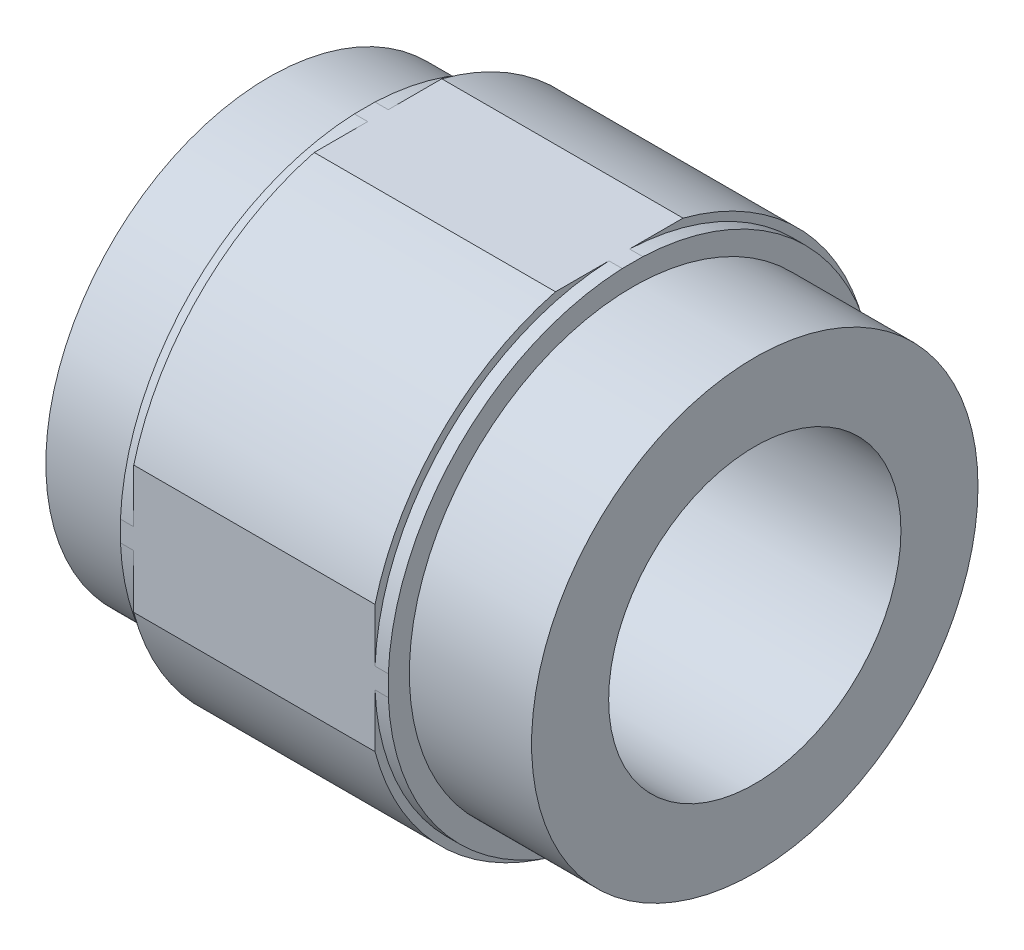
ISO-10303-21;
HEADER;
FILE_DESCRIPTION(('STEP AP214'),'2;1');
FILE_NAME('part.step','',(''),(''),'','','');
FILE_SCHEMA(('AUTOMOTIVE_DESIGN { 1 0 10303 214 1 1 1 1 }'));
ENDSEC;
DATA;
#1=APPLICATION_CONTEXT('core data for automotive mechanical design processes');
#2=APPLICATION_PROTOCOL_DEFINITION('international standard','automotive_design',2000,#1);
#3=PRODUCT_CONTEXT('',#1,'mechanical');
#4=PRODUCT('Part','Part','',(#3));
#5=PRODUCT_RELATED_PRODUCT_CATEGORY('part','',(#4));
#6=PRODUCT_DEFINITION_FORMATION('','',#4);
#7=PRODUCT_DEFINITION_CONTEXT('part definition',#1,'design');
#8=PRODUCT_DEFINITION('design','',#6,#7);
#9=PRODUCT_DEFINITION_SHAPE('','',#8);
#10=(LENGTH_UNIT() NAMED_UNIT(*) SI_UNIT(.MILLI.,.METRE.));
#11=(NAMED_UNIT(*) PLANE_ANGLE_UNIT() SI_UNIT($,.RADIAN.));
#12=(NAMED_UNIT(*) SI_UNIT($,.STERADIAN.) SOLID_ANGLE_UNIT());
#13=UNCERTAINTY_MEASURE_WITH_UNIT(LENGTH_MEASURE(1.E-05),#10,'distance_accuracy_value','');
#14=(GEOMETRIC_REPRESENTATION_CONTEXT(3) GLOBAL_UNCERTAINTY_ASSIGNED_CONTEXT((#13)) GLOBAL_UNIT_ASSIGNED_CONTEXT((#10,
#11,#12)) REPRESENTATION_CONTEXT('',''));
#15=CARTESIAN_POINT('',(0.,0.,0.));
#16=DIRECTION('',(0.,0.,1.));
#17=DIRECTION('',(1.,0.,0.));
#18=AXIS2_PLACEMENT_3D('',#15,#16,#17);
#19=CARTESIAN_POINT('',(-22.7,0.,0.));
#20=DIRECTION('',(1.,0.,0.));
#21=DIRECTION('',(0.,0.,-1.));
#22=AXIS2_PLACEMENT_3D('',#19,#20,#21);
#23=PLANE('',#22);
#24=CARTESIAN_POINT('',(-22.7,0.,0.));
#25=DIRECTION('',(1.,0.,0.));
#26=DIRECTION('',(0.,0.,-1.));
#27=AXIS2_PLACEMENT_3D('',#24,#25,#26);
#28=CIRCLE('',#27,46.);
#29=CARTESIAN_POINT('',(-22.7,-1.9364916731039,-45.959221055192));
#30=VERTEX_POINT('',#29);
#31=CARTESIAN_POINT('',(-22.7,-45.959221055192,-1.93649167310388));
#32=VERTEX_POINT('',#31);
#33=EDGE_CURVE('E189',#30,#32,#28,.F.);
#34=ORIENTED_EDGE('',*,*,#33,.F.);
#35=DIRECTION('',(0.,-1.,0.));
#36=VECTOR('',#35,1.);
#37=CARTESIAN_POINT('',(-22.7,-12.,-45.959221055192));
#38=LINE('',#37,#36);
#39=CARTESIAN_POINT('',(-22.7,-12.,-45.959221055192));
#40=VERTEX_POINT('',#39);
#41=EDGE_CURVE('E179',#30,#40,#38,.T.);
#42=ORIENTED_EDGE('',*,*,#41,.T.);
#43=CARTESIAN_POINT('',(-22.7,0.,0.));
#44=DIRECTION('',(1.,0.,0.));
#45=DIRECTION('',(0.,0.,-1.));
#46=AXIS2_PLACEMENT_3D('',#43,#44,#45);
#47=CIRCLE('',#46,47.5);
#48=CARTESIAN_POINT('',(-22.7,-45.959221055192,-12.));
#49=VERTEX_POINT('',#48);
#50=EDGE_CURVE('E19',#49,#40,#47,.T.);
#51=ORIENTED_EDGE('',*,*,#50,.F.);
#52=DIRECTION('',(0.,0.,1.));
#53=VECTOR('',#52,1.);
#54=CARTESIAN_POINT('',(-22.7,-45.959221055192,12.));
#55=LINE('',#54,#53);
#56=EDGE_CURVE('E176',#49,#32,#55,.T.);
#57=ORIENTED_EDGE('',*,*,#56,.T.);
#58=EDGE_LOOP('',(#34,#42,#51,#57));
#59=FACE_BOUND('',#58,.T.);
#60=ADVANCED_FACE('F15',(#59),#23,.F.);
#61=CARTESIAN_POINT('',(0.,0.,0.));
#62=DIRECTION('',(1.,0.,0.));
#63=DIRECTION('',(0.,0.,-1.));
#64=AXIS2_PLACEMENT_3D('',#61,#62,#63);
#65=CYLINDRICAL_SURFACE('',#64,47.5);
#66=DIRECTION('',(1.,0.,0.));
#67=VECTOR('',#66,1.);
#68=CARTESIAN_POINT('',(-25.2,-12.,-45.959221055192));
#69=LINE('',#68,#67);
#70=CARTESIAN_POINT('',(22.7,-12.,-45.959221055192));
#71=VERTEX_POINT('',#70);
#72=EDGE_CURVE('E323',#40,#71,#69,.T.);
#73=ORIENTED_EDGE('',*,*,#72,.T.);
#74=CARTESIAN_POINT('',(22.7,0.,0.));
#75=DIRECTION('',(1.,0.,0.));
#76=DIRECTION('',(0.,0.,-1.));
#77=AXIS2_PLACEMENT_3D('',#74,#75,#76);
#78=CIRCLE('',#77,47.5);
#79=CARTESIAN_POINT('',(22.7,-45.959221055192,-12.));
#80=VERTEX_POINT('',#79);
#81=EDGE_CURVE('E182',#71,#80,#78,.F.);
#82=ORIENTED_EDGE('',*,*,#81,.T.);
#83=DIRECTION('',(1.,0.,0.));
#84=VECTOR('',#83,1.);
#85=CARTESIAN_POINT('',(-25.2,-45.959221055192,-12.));
#86=LINE('',#85,#84);
#87=EDGE_CURVE('E184',#80,#49,#86,.F.);
#88=ORIENTED_EDGE('',*,*,#87,.T.);
#89=ORIENTED_EDGE('',*,*,#50,.T.);
#90=EDGE_LOOP('',(#73,#82,#88,#89));
#91=FACE_BOUND('',#90,.T.);
#92=ADVANCED_FACE('F185',(#91),#65,.T.);
#93=CARTESIAN_POINT('',(22.7,0.,0.));
#94=DIRECTION('',(-1.,0.,0.));
#95=DIRECTION('',(0.,0.,1.));
#96=AXIS2_PLACEMENT_3D('',#93,#94,#95);
#97=PLANE('',#96);
#98=ORIENTED_EDGE('',*,*,#81,.F.);
#99=DIRECTION('',(0.,-1.,0.));
#100=VECTOR('',#99,1.);
#101=CARTESIAN_POINT('',(22.7,-12.,-45.959221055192));
#102=LINE('',#101,#100);
#103=CARTESIAN_POINT('',(22.7,-1.9364916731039,-45.959221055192));
#104=VERTEX_POINT('',#103);
#105=EDGE_CURVE('E321',#71,#104,#102,.F.);
#106=ORIENTED_EDGE('',*,*,#105,.T.);
#107=CARTESIAN_POINT('',(22.7,0.,0.));
#108=DIRECTION('',(1.,0.,0.));
#109=DIRECTION('',(0.,0.,-1.));
#110=AXIS2_PLACEMENT_3D('',#107,#108,#109);
#111=CIRCLE('',#110,46.);
#112=CARTESIAN_POINT('',(22.7,-45.959221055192,-1.93649167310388));
#113=VERTEX_POINT('',#112);
#114=EDGE_CURVE('E261',#113,#104,#111,.T.);
#115=ORIENTED_EDGE('',*,*,#114,.F.);
#116=DIRECTION('',(0.,0.,1.));
#117=VECTOR('',#116,1.);
#118=CARTESIAN_POINT('',(22.7,-45.959221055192,12.));
#119=LINE('',#118,#117);
#120=EDGE_CURVE('E329',#113,#80,#119,.F.);
#121=ORIENTED_EDGE('',*,*,#120,.T.);
#122=EDGE_LOOP('',(#98,#106,#115,#121));
#123=FACE_BOUND('',#122,.T.);
#124=ADVANCED_FACE('F655',(#123),#97,.F.);
#125=CARTESIAN_POINT('',(-22.7,0.,0.));
#126=DIRECTION('',(1.,0.,0.));
#127=DIRECTION('',(0.,0.,-1.));
#128=AXIS2_PLACEMENT_3D('',#125,#126,#127);
#129=PLANE('',#128);
#130=CARTESIAN_POINT('',(-22.7,0.,0.));
#131=DIRECTION('',(1.,0.,0.));
#132=DIRECTION('',(0.,0.,-1.));
#133=AXIS2_PLACEMENT_3D('',#130,#131,#132);
#134=CIRCLE('',#133,46.);
#135=CARTESIAN_POINT('',(-22.7,45.959221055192,-1.93649167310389));
#136=VERTEX_POINT('',#135);
#137=CARTESIAN_POINT('',(-22.7,1.93649167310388,-45.959221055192));
#138=VERTEX_POINT('',#137);
#139=EDGE_CURVE('E267',#136,#138,#134,.F.);
#140=ORIENTED_EDGE('',*,*,#139,.F.);
#141=DIRECTION('',(0.,0.,-1.));
#142=VECTOR('',#141,1.);
#143=CARTESIAN_POINT('',(-22.7,45.959221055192,-12.));
#144=LINE('',#143,#142);
#145=CARTESIAN_POINT('',(-22.7,45.959221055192,-12.));
#146=VERTEX_POINT('',#145);
#147=EDGE_CURVE('E302',#136,#146,#144,.T.);
#148=ORIENTED_EDGE('',*,*,#147,.T.);
#149=CARTESIAN_POINT('',(-22.7,0.,0.));
#150=DIRECTION('',(1.,0.,0.));
#151=DIRECTION('',(0.,0.,-1.));
#152=AXIS2_PLACEMENT_3D('',#149,#150,#151);
#153=CIRCLE('',#152,47.5);
#154=CARTESIAN_POINT('',(-22.7,12.,-45.959221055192));
#155=VERTEX_POINT('',#154);
#156=EDGE_CURVE('E287',#155,#146,#153,.T.);
#157=ORIENTED_EDGE('',*,*,#156,.F.);
#158=DIRECTION('',(0.,-1.,0.));
#159=VECTOR('',#158,1.);
#160=CARTESIAN_POINT('',(-22.7,-12.,-45.959221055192));
#161=LINE('',#160,#159);
#162=EDGE_CURVE('E320',#155,#138,#161,.T.);
#163=ORIENTED_EDGE('',*,*,#162,.T.);
#164=EDGE_LOOP('',(#140,#148,#157,#163));
#165=FACE_BOUND('',#164,.T.);
#166=ADVANCED_FACE('F648',(#165),#129,.F.);
#167=CARTESIAN_POINT('',(0.,0.,0.));
#168=DIRECTION('',(1.,0.,0.));
#169=DIRECTION('',(0.,0.,-1.));
#170=AXIS2_PLACEMENT_3D('',#167,#168,#169);
#171=CYLINDRICAL_SURFACE('',#170,47.5);
#172=DIRECTION('',(1.,0.,0.));
#173=VECTOR('',#172,1.);
#174=CARTESIAN_POINT('',(-25.2,45.959221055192,-12.));
#175=LINE('',#174,#173);
#176=CARTESIAN_POINT('',(22.7,45.959221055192,-12.));
#177=VERTEX_POINT('',#176);
#178=EDGE_CURVE('E293',#146,#177,#175,.T.);
#179=ORIENTED_EDGE('',*,*,#178,.T.);
#180=CARTESIAN_POINT('',(22.7,0.,0.));
#181=DIRECTION('',(1.,0.,0.));
#182=DIRECTION('',(0.,0.,-1.));
#183=AXIS2_PLACEMENT_3D('',#180,#181,#182);
#184=CIRCLE('',#183,47.5);
#185=CARTESIAN_POINT('',(22.7,12.,-45.959221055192));
#186=VERTEX_POINT('',#185);
#187=EDGE_CURVE('E285',#177,#186,#184,.F.);
#188=ORIENTED_EDGE('',*,*,#187,.T.);
#189=DIRECTION('',(1.,0.,0.));
#190=VECTOR('',#189,1.);
#191=CARTESIAN_POINT('',(-25.2,12.,-45.959221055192));
#192=LINE('',#191,#190);
#193=EDGE_CURVE('E264',#186,#155,#192,.F.);
#194=ORIENTED_EDGE('',*,*,#193,.T.);
#195=ORIENTED_EDGE('',*,*,#156,.T.);
#196=EDGE_LOOP('',(#179,#188,#194,#195));
#197=FACE_BOUND('',#196,.T.);
#198=ADVANCED_FACE('F292',(#197),#171,.T.);
#199=CARTESIAN_POINT('',(22.7,0.,0.));
#200=DIRECTION('',(-1.,0.,0.));
#201=DIRECTION('',(0.,0.,1.));
#202=AXIS2_PLACEMENT_3D('',#199,#200,#201);
#203=PLANE('',#202);
#204=ORIENTED_EDGE('',*,*,#187,.F.);
#205=DIRECTION('',(0.,0.,-1.));
#206=VECTOR('',#205,1.);
#207=CARTESIAN_POINT('',(22.7,45.959221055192,-12.));
#208=LINE('',#207,#206);
#209=CARTESIAN_POINT('',(22.7,45.959221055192,-1.93649167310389));
#210=VERTEX_POINT('',#209);
#211=EDGE_CURVE('E304',#177,#210,#208,.F.);
#212=ORIENTED_EDGE('',*,*,#211,.T.);
#213=CARTESIAN_POINT('',(22.7,0.,0.));
#214=DIRECTION('',(1.,0.,0.));
#215=DIRECTION('',(0.,0.,-1.));
#216=AXIS2_PLACEMENT_3D('',#213,#214,#215);
#217=CIRCLE('',#216,46.);
#218=CARTESIAN_POINT('',(22.7,1.93649167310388,-45.959221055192));
#219=VERTEX_POINT('',#218);
#220=EDGE_CURVE('E256',#219,#210,#217,.T.);
#221=ORIENTED_EDGE('',*,*,#220,.F.);
#222=DIRECTION('',(0.,-1.,0.));
#223=VECTOR('',#222,1.);
#224=CARTESIAN_POINT('',(22.7,-12.,-45.959221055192));
#225=LINE('',#224,#223);
#226=EDGE_CURVE('E315',#219,#186,#225,.F.);
#227=ORIENTED_EDGE('',*,*,#226,.T.);
#228=EDGE_LOOP('',(#204,#212,#221,#227));
#229=FACE_BOUND('',#228,.T.);
#230=ADVANCED_FACE('F529',(#229),#203,.F.);
#231=CARTESIAN_POINT('',(0.,0.,0.));
#232=DIRECTION('',(1.,0.,0.));
#233=DIRECTION('',(0.,0.,-1.));
#234=AXIS2_PLACEMENT_3D('',#231,#232,#233);
#235=CYLINDRICAL_SURFACE('',#234,47.5);
#236=DIRECTION('',(1.,0.,0.));
#237=VECTOR('',#236,1.);
#238=CARTESIAN_POINT('',(-25.2,-12.,45.959221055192));
#239=LINE('',#238,#237);
#240=CARTESIAN_POINT('',(22.7,-12.,45.959221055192));
#241=VERTEX_POINT('',#240);
#242=CARTESIAN_POINT('',(-22.7,-12.,45.959221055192));
#243=VERTEX_POINT('',#242);
#244=EDGE_CURVE('E254',#241,#243,#239,.F.);
#245=ORIENTED_EDGE('',*,*,#244,.T.);
#246=CARTESIAN_POINT('',(-22.7,0.,0.));
#247=DIRECTION('',(1.,0.,0.));
#248=DIRECTION('',(0.,0.,-1.));
#249=AXIS2_PLACEMENT_3D('',#246,#247,#248);
#250=CIRCLE('',#249,47.5);
#251=CARTESIAN_POINT('',(-22.7,-45.959221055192,12.));
#252=VERTEX_POINT('',#251);
#253=EDGE_CURVE('E283',#243,#252,#250,.T.);
#254=ORIENTED_EDGE('',*,*,#253,.T.);
#255=DIRECTION('',(1.,0.,0.));
#256=VECTOR('',#255,1.);
#257=CARTESIAN_POINT('',(-25.2,-45.959221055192,12.));
#258=LINE('',#257,#256);
#259=CARTESIAN_POINT('',(22.7,-45.959221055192,12.));
#260=VERTEX_POINT('',#259);
#261=EDGE_CURVE('E331',#252,#260,#258,.T.);
#262=ORIENTED_EDGE('',*,*,#261,.T.);
#263=CARTESIAN_POINT('',(22.7,0.,0.));
#264=DIRECTION('',(1.,0.,0.));
#265=DIRECTION('',(0.,0.,-1.));
#266=AXIS2_PLACEMENT_3D('',#263,#264,#265);
#267=CIRCLE('',#266,47.5);
#268=EDGE_CURVE('E276',#260,#241,#267,.F.);
#269=ORIENTED_EDGE('',*,*,#268,.T.);
#270=EDGE_LOOP('',(#245,#254,#262,#269));
#271=FACE_BOUND('',#270,.T.);
#272=ADVANCED_FACE('F520',(#271),#235,.T.);
#273=CARTESIAN_POINT('',(-22.7,0.,0.));
#274=DIRECTION('',(1.,0.,0.));
#275=DIRECTION('',(0.,0.,-1.));
#276=AXIS2_PLACEMENT_3D('',#273,#274,#275);
#277=PLANE('',#276);
#278=ORIENTED_EDGE('',*,*,#253,.F.);
#279=DIRECTION('',(0.,1.,0.));
#280=VECTOR('',#279,1.);
#281=CARTESIAN_POINT('',(-22.7,12.,45.959221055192));
#282=LINE('',#281,#280);
#283=CARTESIAN_POINT('',(-22.7,-1.93649167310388,45.959221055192));
#284=VERTEX_POINT('',#283);
#285=EDGE_CURVE('E352',#243,#284,#282,.T.);
#286=ORIENTED_EDGE('',*,*,#285,.T.);
#287=CARTESIAN_POINT('',(-22.7,0.,0.));
#288=DIRECTION('',(1.,0.,0.));
#289=DIRECTION('',(0.,0.,-1.));
#290=AXIS2_PLACEMENT_3D('',#287,#288,#289);
#291=CIRCLE('',#290,46.);
#292=CARTESIAN_POINT('',(-22.7,-45.959221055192,1.93649167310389));
#293=VERTEX_POINT('',#292);
#294=EDGE_CURVE('E273',#293,#284,#291,.F.);
#295=ORIENTED_EDGE('',*,*,#294,.F.);
#296=DIRECTION('',(0.,0.,1.));
#297=VECTOR('',#296,1.);
#298=CARTESIAN_POINT('',(-22.7,-45.959221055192,12.));
#299=LINE('',#298,#297);
#300=EDGE_CURVE('E199',#293,#252,#299,.T.);
#301=ORIENTED_EDGE('',*,*,#300,.T.);
#302=EDGE_LOOP('',(#278,#286,#295,#301));
#303=FACE_BOUND('',#302,.T.);
#304=ADVANCED_FACE('F521',(#303),#277,.F.);
#305=CARTESIAN_POINT('',(-22.7,0.,0.));
#306=DIRECTION('',(1.,0.,0.));
#307=DIRECTION('',(0.,0.,-1.));
#308=AXIS2_PLACEMENT_3D('',#305,#306,#307);
#309=PLANE('',#308);
#310=CARTESIAN_POINT('',(-22.7,0.,0.));
#311=DIRECTION('',(1.,0.,0.));
#312=DIRECTION('',(0.,0.,-1.));
#313=AXIS2_PLACEMENT_3D('',#310,#311,#312);
#314=CIRCLE('',#313,47.5);
#315=CARTESIAN_POINT('',(-22.7,45.959221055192,12.));
#316=VERTEX_POINT('',#315);
#317=CARTESIAN_POINT('',(-22.7,12.,45.959221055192));
#318=VERTEX_POINT('',#317);
#319=EDGE_CURVE('E280',#316,#318,#314,.T.);
#320=ORIENTED_EDGE('',*,*,#319,.F.);
#321=DIRECTION('',(0.,0.,-1.));
#322=VECTOR('',#321,1.);
#323=CARTESIAN_POINT('',(-22.7,45.959221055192,-12.));
#324=LINE('',#323,#322);
#325=CARTESIAN_POINT('',(-22.7,45.959221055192,1.93649167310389));
#326=VERTEX_POINT('',#325);
#327=EDGE_CURVE('E312',#316,#326,#324,.T.);
#328=ORIENTED_EDGE('',*,*,#327,.T.);
#329=CARTESIAN_POINT('',(-22.7,0.,0.));
#330=DIRECTION('',(1.,0.,0.));
#331=DIRECTION('',(0.,0.,-1.));
#332=AXIS2_PLACEMENT_3D('',#329,#330,#331);
#333=CIRCLE('',#332,46.);
#334=CARTESIAN_POINT('',(-22.7,1.9364916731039,45.959221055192));
#335=VERTEX_POINT('',#334);
#336=EDGE_CURVE('E270',#335,#326,#333,.F.);
#337=ORIENTED_EDGE('',*,*,#336,.F.);
#338=DIRECTION('',(0.,1.,0.));
#339=VECTOR('',#338,1.);
#340=CARTESIAN_POINT('',(-22.7,12.,45.959221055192));
#341=LINE('',#340,#339);
#342=EDGE_CURVE('E357',#335,#318,#341,.T.);
#343=ORIENTED_EDGE('',*,*,#342,.T.);
#344=EDGE_LOOP('',(#320,#328,#337,#343));
#345=FACE_BOUND('',#344,.T.);
#346=ADVANCED_FACE('F374',(#345),#309,.F.);
#347=CARTESIAN_POINT('',(0.,0.,0.));
#348=DIRECTION('',(1.,0.,0.));
#349=DIRECTION('',(0.,0.,-1.));
#350=AXIS2_PLACEMENT_3D('',#347,#348,#349);
#351=CYLINDRICAL_SURFACE('',#350,47.5);
#352=DIRECTION('',(1.,0.,0.));
#353=VECTOR('',#352,1.);
#354=CARTESIAN_POINT('',(-25.2,45.959221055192,12.));
#355=LINE('',#354,#353);
#356=CARTESIAN_POINT('',(22.7,45.959221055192,12.));
#357=VERTEX_POINT('',#356);
#358=EDGE_CURVE('E259',#357,#316,#355,.F.);
#359=ORIENTED_EDGE('',*,*,#358,.T.);
#360=ORIENTED_EDGE('',*,*,#319,.T.);
#361=DIRECTION('',(1.,0.,0.));
#362=VECTOR('',#361,1.);
#363=CARTESIAN_POINT('',(-25.2,12.,45.959221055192));
#364=LINE('',#363,#362);
#365=CARTESIAN_POINT('',(22.7,12.,45.959221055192));
#366=VERTEX_POINT('',#365);
#367=EDGE_CURVE('E355',#318,#366,#364,.T.);
#368=ORIENTED_EDGE('',*,*,#367,.T.);
#369=CARTESIAN_POINT('',(22.7,0.,0.));
#370=DIRECTION('',(1.,0.,0.));
#371=DIRECTION('',(0.,0.,-1.));
#372=AXIS2_PLACEMENT_3D('',#369,#370,#371);
#373=CIRCLE('',#372,47.5);
#374=EDGE_CURVE('E278',#366,#357,#373,.F.);
#375=ORIENTED_EDGE('',*,*,#374,.T.);
#376=EDGE_LOOP('',(#359,#360,#368,#375));
#377=FACE_BOUND('',#376,.T.);
#378=ADVANCED_FACE('F368',(#377),#351,.T.);
#379=CARTESIAN_POINT('',(22.7,0.,0.));
#380=DIRECTION('',(-1.,0.,0.));
#381=DIRECTION('',(0.,0.,1.));
#382=AXIS2_PLACEMENT_3D('',#379,#380,#381);
#383=PLANE('',#382);
#384=CARTESIAN_POINT('',(22.7,0.,0.));
#385=DIRECTION('',(1.,0.,0.));
#386=DIRECTION('',(0.,0.,-1.));
#387=AXIS2_PLACEMENT_3D('',#384,#385,#386);
#388=CIRCLE('',#387,46.);
#389=CARTESIAN_POINT('',(22.7,45.959221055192,1.93649167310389));
#390=VERTEX_POINT('',#389);
#391=CARTESIAN_POINT('',(22.7,1.9364916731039,45.959221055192));
#392=VERTEX_POINT('',#391);
#393=EDGE_CURVE('E251',#390,#392,#388,.T.);
#394=ORIENTED_EDGE('',*,*,#393,.F.);
#395=DIRECTION('',(0.,0.,-1.));
#396=VECTOR('',#395,1.);
#397=CARTESIAN_POINT('',(22.7,45.959221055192,-12.));
#398=LINE('',#397,#396);
#399=EDGE_CURVE('E362',#390,#357,#398,.F.);
#400=ORIENTED_EDGE('',*,*,#399,.T.);
#401=ORIENTED_EDGE('',*,*,#374,.F.);
#402=DIRECTION('',(0.,1.,0.));
#403=VECTOR('',#402,1.);
#404=CARTESIAN_POINT('',(22.7,12.,45.959221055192));
#405=LINE('',#404,#403);
#406=EDGE_CURVE('E353',#366,#392,#405,.F.);
#407=ORIENTED_EDGE('',*,*,#406,.T.);
#408=EDGE_LOOP('',(#394,#400,#401,#407));
#409=FACE_BOUND('',#408,.T.);
#410=ADVANCED_FACE('F387',(#409),#383,.F.);
#411=CARTESIAN_POINT('',(22.7,0.,0.));
#412=DIRECTION('',(-1.,0.,0.));
#413=DIRECTION('',(0.,0.,1.));
#414=AXIS2_PLACEMENT_3D('',#411,#412,#413);
#415=PLANE('',#414);
#416=CARTESIAN_POINT('',(22.7,0.,0.));
#417=DIRECTION('',(1.,0.,0.));
#418=DIRECTION('',(0.,0.,-1.));
#419=AXIS2_PLACEMENT_3D('',#416,#417,#418);
#420=CIRCLE('',#419,46.);
#421=CARTESIAN_POINT('',(22.7,-1.93649167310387,45.959221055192));
#422=VERTEX_POINT('',#421);
#423=CARTESIAN_POINT('',(22.7,-45.959221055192,1.9364916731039));
#424=VERTEX_POINT('',#423);
#425=EDGE_CURVE('E248',#422,#424,#420,.T.);
#426=ORIENTED_EDGE('',*,*,#425,.F.);
#427=DIRECTION('',(0.,1.,0.));
#428=VECTOR('',#427,1.);
#429=CARTESIAN_POINT('',(22.7,12.,45.959221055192));
#430=LINE('',#429,#428);
#431=EDGE_CURVE('E346',#422,#241,#430,.F.);
#432=ORIENTED_EDGE('',*,*,#431,.T.);
#433=ORIENTED_EDGE('',*,*,#268,.F.);
#434=DIRECTION('',(0.,0.,1.));
#435=VECTOR('',#434,1.);
#436=CARTESIAN_POINT('',(22.7,-45.959221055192,12.));
#437=LINE('',#436,#435);
#438=EDGE_CURVE('E330',#260,#424,#437,.F.);
#439=ORIENTED_EDGE('',*,*,#438,.T.);
#440=EDGE_LOOP('',(#426,#432,#433,#439));
#441=FACE_BOUND('',#440,.T.);
#442=ADVANCED_FACE('F518',(#441),#415,.F.);
#443=CARTESIAN_POINT('',(-25.2,0.,0.));
#444=DIRECTION('',(1.,0.,0.));
#445=DIRECTION('',(0.,0.,-1.));
#446=AXIS2_PLACEMENT_3D('',#443,#444,#445);
#447=CYLINDRICAL_SURFACE('',#446,46.);
#448=DIRECTION('',(1.,0.,0.));
#449=VECTOR('',#448,1.);
#450=CARTESIAN_POINT('',(-25.2,-1.93649167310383,45.959221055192));
#451=LINE('',#450,#449);
#452=CARTESIAN_POINT('',(-25.2,-1.93649167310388,45.959221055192));
#453=VERTEX_POINT('',#452);
#454=EDGE_CURVE('E361',#284,#453,#451,.F.);
#455=ORIENTED_EDGE('',*,*,#454,.T.);
#456=CARTESIAN_POINT('',(-25.2,0.,0.));
#457=DIRECTION('',(1.,0.,0.));
#458=DIRECTION('',(0.,0.,-1.));
#459=AXIS2_PLACEMENT_3D('',#456,#457,#458);
#460=CIRCLE('',#459,46.);
#461=CARTESIAN_POINT('',(-25.2,-45.959221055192,1.93649167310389));
#462=VERTEX_POINT('',#461);
#463=EDGE_CURVE('E244',#462,#453,#460,.F.);
#464=ORIENTED_EDGE('',*,*,#463,.F.);
#465=DIRECTION('',(1.,0.,0.));
#466=VECTOR('',#465,1.);
#467=CARTESIAN_POINT('',(-25.2,-45.959221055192,1.93649167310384));
#468=LINE('',#467,#466);
#469=EDGE_CURVE('E196',#462,#293,#468,.T.);
#470=ORIENTED_EDGE('',*,*,#469,.T.);
#471=ORIENTED_EDGE('',*,*,#294,.T.);
#472=EDGE_LOOP('',(#455,#464,#470,#471));
#473=FACE_BOUND('',#472,.T.);
#474=ADVANCED_FACE('F425',(#473),#447,.T.);
#475=CARTESIAN_POINT('',(-25.2,0.,0.));
#476=DIRECTION('',(1.,0.,0.));
#477=DIRECTION('',(0.,0.,-1.));
#478=AXIS2_PLACEMENT_3D('',#475,#476,#477);
#479=CYLINDRICAL_SURFACE('',#478,46.);
#480=DIRECTION('',(1.,0.,0.));
#481=VECTOR('',#480,1.);
#482=CARTESIAN_POINT('',(-25.2,45.959221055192,1.93649167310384));
#483=LINE('',#482,#481);
#484=CARTESIAN_POINT('',(-25.2,45.959221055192,1.93649167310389));
#485=VERTEX_POINT('',#484);
#486=EDGE_CURVE('E314',#326,#485,#483,.F.);
#487=ORIENTED_EDGE('',*,*,#486,.T.);
#488=CARTESIAN_POINT('',(-25.2,0.,0.));
#489=DIRECTION('',(1.,0.,0.));
#490=DIRECTION('',(0.,0.,-1.));
#491=AXIS2_PLACEMENT_3D('',#488,#489,#490);
#492=CIRCLE('',#491,46.);
#493=CARTESIAN_POINT('',(-25.2,1.93649167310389,45.959221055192));
#494=VERTEX_POINT('',#493);
#495=EDGE_CURVE('E240',#494,#485,#492,.F.);
#496=ORIENTED_EDGE('',*,*,#495,.F.);
#497=DIRECTION('',(1.,0.,0.));
#498=VECTOR('',#497,1.);
#499=CARTESIAN_POINT('',(-25.2,1.93649167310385,45.959221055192));
#500=LINE('',#499,#498);
#501=EDGE_CURVE('E359',#494,#335,#500,.T.);
#502=ORIENTED_EDGE('',*,*,#501,.T.);
#503=ORIENTED_EDGE('',*,*,#336,.T.);
#504=EDGE_LOOP('',(#487,#496,#502,#503));
#505=FACE_BOUND('',#504,.T.);
#506=ADVANCED_FACE('F377',(#505),#479,.T.);
#507=CARTESIAN_POINT('',(-25.2,0.,0.));
#508=DIRECTION('',(1.,0.,0.));
#509=DIRECTION('',(0.,0.,-1.));
#510=AXIS2_PLACEMENT_3D('',#507,#508,#509);
#511=CYLINDRICAL_SURFACE('',#510,46.);
#512=DIRECTION('',(1.,0.,0.));
#513=VECTOR('',#512,1.);
#514=CARTESIAN_POINT('',(-25.2,45.959221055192,-1.93649167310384));
#515=LINE('',#514,#513);
#516=CARTESIAN_POINT('',(-25.2,45.959221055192,-1.93649167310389));
#517=VERTEX_POINT('',#516);
#518=EDGE_CURVE('E308',#517,#136,#515,.T.);
#519=ORIENTED_EDGE('',*,*,#518,.T.);
#520=ORIENTED_EDGE('',*,*,#139,.T.);
#521=DIRECTION('',(1.,0.,0.));
#522=VECTOR('',#521,1.);
#523=CARTESIAN_POINT('',(-25.2,1.93649167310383,-45.959221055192));
#524=LINE('',#523,#522);
#525=CARTESIAN_POINT('',(-25.2,1.93649167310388,-45.959221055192));
#526=VERTEX_POINT('',#525);
#527=EDGE_CURVE('E328',#138,#526,#524,.F.);
#528=ORIENTED_EDGE('',*,*,#527,.T.);
#529=CARTESIAN_POINT('',(-25.2,0.,0.));
#530=DIRECTION('',(1.,0.,0.));
#531=DIRECTION('',(0.,0.,-1.));
#532=AXIS2_PLACEMENT_3D('',#529,#530,#531);
#533=CIRCLE('',#532,46.);
#534=EDGE_CURVE('E236',#517,#526,#533,.F.);
#535=ORIENTED_EDGE('',*,*,#534,.F.);
#536=EDGE_LOOP('',(#519,#520,#528,#535));
#537=FACE_BOUND('',#536,.T.);
#538=ADVANCED_FACE('F444',(#537),#511,.T.);
#539=CARTESIAN_POINT('',(-25.2,0.,0.));
#540=DIRECTION('',(1.,0.,0.));
#541=DIRECTION('',(0.,0.,-1.));
#542=AXIS2_PLACEMENT_3D('',#539,#540,#541);
#543=CYLINDRICAL_SURFACE('',#542,46.);
#544=DIRECTION('',(1.,0.,0.));
#545=VECTOR('',#544,1.);
#546=CARTESIAN_POINT('',(-25.2,-1.93649167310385,-45.959221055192));
#547=LINE('',#546,#545);
#548=CARTESIAN_POINT('',(-25.2,-1.93649167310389,-45.959221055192));
#549=VERTEX_POINT('',#548);
#550=EDGE_CURVE('E326',#549,#30,#547,.T.);
#551=ORIENTED_EDGE('',*,*,#550,.T.);
#552=ORIENTED_EDGE('',*,*,#33,.T.);
#553=DIRECTION('',(1.,0.,0.));
#554=VECTOR('',#553,1.);
#555=CARTESIAN_POINT('',(-25.2,-45.959221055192,-1.93649167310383));
#556=LINE('',#555,#554);
#557=CARTESIAN_POINT('',(-25.2,-45.959221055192,-1.93649167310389));
#558=VERTEX_POINT('',#557);
#559=EDGE_CURVE('E194',#32,#558,#556,.F.);
#560=ORIENTED_EDGE('',*,*,#559,.T.);
#561=CARTESIAN_POINT('',(-25.2,0.,0.));
#562=DIRECTION('',(1.,0.,0.));
#563=DIRECTION('',(0.,0.,-1.));
#564=AXIS2_PLACEMENT_3D('',#561,#562,#563);
#565=CIRCLE('',#564,46.);
#566=EDGE_CURVE('E232',#549,#558,#565,.F.);
#567=ORIENTED_EDGE('',*,*,#566,.F.);
#568=EDGE_LOOP('',(#551,#552,#560,#567));
#569=FACE_BOUND('',#568,.T.);
#570=ADVANCED_FACE('F442',(#569),#543,.T.);
#571=CARTESIAN_POINT('',(-25.2,-45.959221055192,12.));
#572=DIRECTION('',(0.,1.,0.));
#573=DIRECTION('',(0.,0.,1.));
#574=AXIS2_PLACEMENT_3D('',#571,#572,#573);
#575=PLANE('',#574);
#576=DIRECTION('',(1.,0.,0.));
#577=VECTOR('',#576,1.);
#578=CARTESIAN_POINT('',(25.2,-45.959221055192,-1.93649167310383));
#579=LINE('',#578,#577);
#580=CARTESIAN_POINT('',(25.2,-45.959221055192,-1.9364916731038));
#581=VERTEX_POINT('',#580);
#582=EDGE_CURVE('E265',#581,#113,#579,.F.);
#583=ORIENTED_EDGE('',*,*,#582,.F.);
#584=DIRECTION('',(0.,0.,-1.));
#585=VECTOR('',#584,1.);
#586=CARTESIAN_POINT('',(25.2,-45.959221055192,0.));
#587=LINE('',#586,#585);
#588=CARTESIAN_POINT('',(25.2,-45.959221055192,1.93649167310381));
#589=VERTEX_POINT('',#588);
#590=EDGE_CURVE('E231',#589,#581,#587,.T.);
#591=ORIENTED_EDGE('',*,*,#590,.F.);
#592=DIRECTION('',(1.,0.,0.));
#593=VECTOR('',#592,1.);
#594=CARTESIAN_POINT('',(25.2,-45.959221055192,1.93649167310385));
#595=LINE('',#594,#593);
#596=EDGE_CURVE('E348',#424,#589,#595,.T.);
#597=ORIENTED_EDGE('',*,*,#596,.F.);
#598=ORIENTED_EDGE('',*,*,#438,.F.);
#599=ORIENTED_EDGE('',*,*,#261,.F.);
#600=ORIENTED_EDGE('',*,*,#300,.F.);
#601=ORIENTED_EDGE('',*,*,#469,.F.);
#602=DIRECTION('',(0.,0.,1.));
#603=VECTOR('',#602,1.);
#604=CARTESIAN_POINT('',(-25.2,-45.959221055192,0.));
#605=LINE('',#604,#603);
#606=EDGE_CURVE('E247',#558,#462,#605,.T.);
#607=ORIENTED_EDGE('',*,*,#606,.F.);
#608=ORIENTED_EDGE('',*,*,#559,.F.);
#609=ORIENTED_EDGE('',*,*,#56,.F.);
#610=ORIENTED_EDGE('',*,*,#87,.F.);
#611=ORIENTED_EDGE('',*,*,#120,.F.);
#612=EDGE_LOOP('',(#583,#591,#597,#598,#599,#600,#601,#607,#608,#609,#610,#611));
#613=FACE_BOUND('',#612,.T.);
#614=ADVANCED_FACE('F192',(#613),#575,.F.);
#615=CARTESIAN_POINT('',(25.2,0.,0.));
#616=DIRECTION('',(1.,0.,0.));
#617=DIRECTION('',(0.,0.,-1.));
#618=AXIS2_PLACEMENT_3D('',#615,#616,#617);
#619=CYLINDRICAL_SURFACE('',#618,46.);
#620=DIRECTION('',(1.,0.,0.));
#621=VECTOR('',#620,1.);
#622=CARTESIAN_POINT('',(-25.2,-1.93649167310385,-45.959221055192));
#623=LINE('',#622,#621);
#624=CARTESIAN_POINT('',(25.2,-1.93649167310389,-45.959221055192));
#625=VERTEX_POINT('',#624);
#626=EDGE_CURVE('E318',#104,#625,#623,.T.);
#627=ORIENTED_EDGE('',*,*,#626,.T.);
#628=CARTESIAN_POINT('',(25.2,0.,0.));
#629=DIRECTION('',(1.,0.,0.));
#630=DIRECTION('',(0.,0.,-1.));
#631=AXIS2_PLACEMENT_3D('',#628,#629,#630);
#632=CIRCLE('',#631,46.);
#633=EDGE_CURVE('E228',#581,#625,#632,.T.);
#634=ORIENTED_EDGE('',*,*,#633,.F.);
#635=ORIENTED_EDGE('',*,*,#582,.T.);
#636=ORIENTED_EDGE('',*,*,#114,.T.);
#637=EDGE_LOOP('',(#627,#634,#635,#636));
#638=FACE_BOUND('',#637,.T.);
#639=ADVANCED_FACE('F451',(#638),#619,.T.);
#640=CARTESIAN_POINT('',(-25.2,-12.,-45.959221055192));
#641=DIRECTION('',(0.,0.,1.));
#642=DIRECTION('',(0.,-1.,0.));
#643=AXIS2_PLACEMENT_3D('',#640,#641,#642);
#644=PLANE('',#643);
#645=DIRECTION('',(1.,0.,0.));
#646=VECTOR('',#645,1.);
#647=CARTESIAN_POINT('',(25.2,1.93649167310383,-45.959221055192));
#648=LINE('',#647,#646);
#649=CARTESIAN_POINT('',(25.2,1.93649167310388,-45.959221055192));
#650=VERTEX_POINT('',#649);
#651=EDGE_CURVE('E260',#650,#219,#648,.F.);
#652=ORIENTED_EDGE('',*,*,#651,.F.);
#653=DIRECTION('',(0.,1.,0.));
#654=VECTOR('',#653,1.);
#655=CARTESIAN_POINT('',(25.2,44.75,-45.959221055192));
#656=LINE('',#655,#654);
#657=EDGE_CURVE('E227',#625,#650,#656,.T.);
#658=ORIENTED_EDGE('',*,*,#657,.F.);
#659=ORIENTED_EDGE('',*,*,#626,.F.);
#660=ORIENTED_EDGE('',*,*,#105,.F.);
#661=ORIENTED_EDGE('',*,*,#72,.F.);
#662=ORIENTED_EDGE('',*,*,#41,.F.);
#663=ORIENTED_EDGE('',*,*,#550,.F.);
#664=DIRECTION('',(0.,1.,0.));
#665=VECTOR('',#664,1.);
#666=CARTESIAN_POINT('',(-25.2,44.75,-45.959221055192));
#667=LINE('',#666,#665);
#668=EDGE_CURVE('E235',#526,#549,#667,.F.);
#669=ORIENTED_EDGE('',*,*,#668,.F.);
#670=ORIENTED_EDGE('',*,*,#527,.F.);
#671=ORIENTED_EDGE('',*,*,#162,.F.);
#672=ORIENTED_EDGE('',*,*,#193,.F.);
#673=ORIENTED_EDGE('',*,*,#226,.F.);
#674=EDGE_LOOP('',(#652,#658,#659,#660,#661,#662,#663,#669,#670,#671,#672,#673));
#675=FACE_BOUND('',#674,.T.);
#676=ADVANCED_FACE('F440',(#675),#644,.F.);
#677=CARTESIAN_POINT('',(25.2,0.,0.));
#678=DIRECTION('',(1.,0.,0.));
#679=DIRECTION('',(0.,0.,-1.));
#680=AXIS2_PLACEMENT_3D('',#677,#678,#679);
#681=CYLINDRICAL_SURFACE('',#680,46.);
#682=DIRECTION('',(1.,0.,0.));
#683=VECTOR('',#682,1.);
#684=CARTESIAN_POINT('',(-25.2,45.959221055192,-1.93649167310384));
#685=LINE('',#684,#683);
#686=CARTESIAN_POINT('',(25.2,45.959221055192,-1.93649167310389));
#687=VERTEX_POINT('',#686);
#688=EDGE_CURVE('E306',#210,#687,#685,.T.);
#689=ORIENTED_EDGE('',*,*,#688,.T.);
#690=CARTESIAN_POINT('',(25.2,0.,0.));
#691=DIRECTION('',(1.,0.,0.));
#692=DIRECTION('',(0.,0.,-1.));
#693=AXIS2_PLACEMENT_3D('',#690,#691,#692);
#694=CIRCLE('',#693,46.);
#695=EDGE_CURVE('E224',#650,#687,#694,.T.);
#696=ORIENTED_EDGE('',*,*,#695,.F.);
#697=ORIENTED_EDGE('',*,*,#651,.T.);
#698=ORIENTED_EDGE('',*,*,#220,.T.);
#699=EDGE_LOOP('',(#689,#696,#697,#698));
#700=FACE_BOUND('',#699,.T.);
#701=ADVANCED_FACE('F499',(#700),#681,.T.);
#702=CARTESIAN_POINT('',(-25.2,45.959221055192,-12.));
#703=DIRECTION('',(0.,-1.,0.));
#704=DIRECTION('',(0.,0.,-1.));
#705=AXIS2_PLACEMENT_3D('',#702,#703,#704);
#706=PLANE('',#705);
#707=DIRECTION('',(1.,0.,0.));
#708=VECTOR('',#707,1.);
#709=CARTESIAN_POINT('',(25.2,45.959221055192,1.93649167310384));
#710=LINE('',#709,#708);
#711=CARTESIAN_POINT('',(25.2,45.959221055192,1.93649167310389));
#712=VERTEX_POINT('',#711);
#713=EDGE_CURVE('E255',#712,#390,#710,.F.);
#714=ORIENTED_EDGE('',*,*,#713,.F.);
#715=DIRECTION('',(0.,0.,-1.));
#716=VECTOR('',#715,1.);
#717=CARTESIAN_POINT('',(25.2,45.959221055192,0.));
#718=LINE('',#717,#716);
#719=EDGE_CURVE('E223',#687,#712,#718,.F.);
#720=ORIENTED_EDGE('',*,*,#719,.F.);
#721=ORIENTED_EDGE('',*,*,#688,.F.);
#722=ORIENTED_EDGE('',*,*,#211,.F.);
#723=ORIENTED_EDGE('',*,*,#178,.F.);
#724=ORIENTED_EDGE('',*,*,#147,.F.);
#725=ORIENTED_EDGE('',*,*,#518,.F.);
#726=DIRECTION('',(0.,0.,1.));
#727=VECTOR('',#726,1.);
#728=CARTESIAN_POINT('',(-25.2,45.959221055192,0.));
#729=LINE('',#728,#727);
#730=EDGE_CURVE('E239',#485,#517,#729,.F.);
#731=ORIENTED_EDGE('',*,*,#730,.F.);
#732=ORIENTED_EDGE('',*,*,#486,.F.);
#733=ORIENTED_EDGE('',*,*,#327,.F.);
#734=ORIENTED_EDGE('',*,*,#358,.F.);
#735=ORIENTED_EDGE('',*,*,#399,.F.);
#736=EDGE_LOOP('',(#714,#720,#721,#722,#723,#724,#725,#731,#732,#733,#734,#735));
#737=FACE_BOUND('',#736,.T.);
#738=ADVANCED_FACE('F301',(#737),#706,.F.);
#739=CARTESIAN_POINT('',(25.2,0.,0.));
#740=DIRECTION('',(1.,0.,0.));
#741=DIRECTION('',(0.,0.,-1.));
#742=AXIS2_PLACEMENT_3D('',#739,#740,#741);
#743=CYLINDRICAL_SURFACE('',#742,46.);
#744=ORIENTED_EDGE('',*,*,#713,.T.);
#745=ORIENTED_EDGE('',*,*,#393,.T.);
#746=DIRECTION('',(1.,0.,0.));
#747=VECTOR('',#746,1.);
#748=CARTESIAN_POINT('',(-25.2,1.93649167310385,45.959221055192));
#749=LINE('',#748,#747);
#750=CARTESIAN_POINT('',(25.2,1.93649167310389,45.959221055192));
#751=VERTEX_POINT('',#750);
#752=EDGE_CURVE('E349',#392,#751,#749,.T.);
#753=ORIENTED_EDGE('',*,*,#752,.T.);
#754=CARTESIAN_POINT('',(25.2,0.,0.));
#755=DIRECTION('',(1.,0.,0.));
#756=DIRECTION('',(0.,0.,-1.));
#757=AXIS2_PLACEMENT_3D('',#754,#755,#756);
#758=CIRCLE('',#757,46.);
#759=EDGE_CURVE('E220',#712,#751,#758,.T.);
#760=ORIENTED_EDGE('',*,*,#759,.F.);
#761=EDGE_LOOP('',(#744,#745,#753,#760));
#762=FACE_BOUND('',#761,.T.);
#763=ADVANCED_FACE('F394',(#762),#743,.T.);
#764=CARTESIAN_POINT('',(-25.2,12.,45.959221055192));
#765=DIRECTION('',(0.,0.,-1.));
#766=DIRECTION('',(0.,1.,0.));
#767=AXIS2_PLACEMENT_3D('',#764,#765,#766);
#768=PLANE('',#767);
#769=DIRECTION('',(1.,0.,0.));
#770=VECTOR('',#769,1.);
#771=CARTESIAN_POINT('',(25.2,-1.93649167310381,45.959221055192));
#772=LINE('',#771,#770);
#773=CARTESIAN_POINT('',(25.2,-1.93649167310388,45.959221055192));
#774=VERTEX_POINT('',#773);
#775=EDGE_CURVE('E34',#774,#422,#772,.F.);
#776=ORIENTED_EDGE('',*,*,#775,.F.);
#777=DIRECTION('',(0.,1.,0.));
#778=VECTOR('',#777,1.);
#779=CARTESIAN_POINT('',(25.2,44.75,45.959221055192));
#780=LINE('',#779,#778);
#781=EDGE_CURVE('E219',#751,#774,#780,.F.);
#782=ORIENTED_EDGE('',*,*,#781,.F.);
#783=ORIENTED_EDGE('',*,*,#752,.F.);
#784=ORIENTED_EDGE('',*,*,#406,.F.);
#785=ORIENTED_EDGE('',*,*,#367,.F.);
#786=ORIENTED_EDGE('',*,*,#342,.F.);
#787=ORIENTED_EDGE('',*,*,#501,.F.);
#788=DIRECTION('',(0.,1.,0.));
#789=VECTOR('',#788,1.);
#790=CARTESIAN_POINT('',(-25.2,44.75,45.959221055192));
#791=LINE('',#790,#789);
#792=EDGE_CURVE('E243',#453,#494,#791,.T.);
#793=ORIENTED_EDGE('',*,*,#792,.F.);
#794=ORIENTED_EDGE('',*,*,#454,.F.);
#795=ORIENTED_EDGE('',*,*,#285,.F.);
#796=ORIENTED_EDGE('',*,*,#244,.F.);
#797=ORIENTED_EDGE('',*,*,#431,.F.);
#798=EDGE_LOOP('',(#776,#782,#783,#784,#785,#786,#787,#793,#794,#795,#796,#797));
#799=FACE_BOUND('',#798,.T.);
#800=ADVANCED_FACE('F382',(#799),#768,.F.);
#801=CARTESIAN_POINT('',(25.2,0.,0.));
#802=DIRECTION('',(1.,0.,0.));
#803=DIRECTION('',(0.,0.,-1.));
#804=AXIS2_PLACEMENT_3D('',#801,#802,#803);
#805=CYLINDRICAL_SURFACE('',#804,46.);
#806=ORIENTED_EDGE('',*,*,#775,.T.);
#807=ORIENTED_EDGE('',*,*,#425,.T.);
#808=ORIENTED_EDGE('',*,*,#596,.T.);
#809=CARTESIAN_POINT('',(25.2,0.,0.));
#810=DIRECTION('',(1.,0.,0.));
#811=DIRECTION('',(0.,0.,-1.));
#812=AXIS2_PLACEMENT_3D('',#809,#810,#811);
#813=CIRCLE('',#812,46.);
#814=EDGE_CURVE('E216',#774,#589,#813,.T.);
#815=ORIENTED_EDGE('',*,*,#814,.F.);
#816=EDGE_LOOP('',(#806,#807,#808,#815));
#817=FACE_BOUND('',#816,.T.);
#818=ADVANCED_FACE('F488',(#817),#805,.T.);
#819=CARTESIAN_POINT('',(-25.2,44.75,0.));
#820=DIRECTION('',(-1.,0.,0.));
#821=DIRECTION('',(0.,0.,1.));
#822=AXIS2_PLACEMENT_3D('',#819,#820,#821);
#823=PLANE('',#822);
#824=CARTESIAN_POINT('',(-25.2,0.,0.));
#825=DIRECTION('',(1.,0.,0.));
#826=DIRECTION('',(0.,0.,-1.));
#827=AXIS2_PLACEMENT_3D('',#824,#825,#826);
#828=CIRCLE('',#827,42.);
#829=CARTESIAN_POINT('',(-25.2,0.,-42.));
#830=VERTEX_POINT('',#829);
#831=EDGE_CURVE('E213',#830,#830,#828,.F.);
#832=ORIENTED_EDGE('',*,*,#831,.F.);
#833=EDGE_LOOP('',(#832));
#834=FACE_BOUND('',#833,.T.);
#835=ORIENTED_EDGE('',*,*,#668,.T.);
#836=ORIENTED_EDGE('',*,*,#566,.T.);
#837=ORIENTED_EDGE('',*,*,#606,.T.);
#838=ORIENTED_EDGE('',*,*,#463,.T.);
#839=ORIENTED_EDGE('',*,*,#792,.T.);
#840=ORIENTED_EDGE('',*,*,#495,.T.);
#841=ORIENTED_EDGE('',*,*,#730,.T.);
#842=ORIENTED_EDGE('',*,*,#534,.T.);
#843=EDGE_LOOP('',(#835,#836,#837,#838,#839,#840,#841,#842));
#844=FACE_BOUND('',#843,.T.);
#845=ADVANCED_FACE('F431',(#834,#844),#823,.T.);
#846=CARTESIAN_POINT('',(25.2,44.75,0.));
#847=DIRECTION('',(1.,0.,0.));
#848=DIRECTION('',(0.,0.,-1.));
#849=AXIS2_PLACEMENT_3D('',#846,#847,#848);
#850=PLANE('',#849);
#851=ORIENTED_EDGE('',*,*,#781,.T.);
#852=ORIENTED_EDGE('',*,*,#814,.T.);
#853=ORIENTED_EDGE('',*,*,#590,.T.);
#854=ORIENTED_EDGE('',*,*,#633,.T.);
#855=ORIENTED_EDGE('',*,*,#657,.T.);
#856=ORIENTED_EDGE('',*,*,#695,.T.);
#857=ORIENTED_EDGE('',*,*,#719,.T.);
#858=ORIENTED_EDGE('',*,*,#759,.T.);
#859=EDGE_LOOP('',(#851,#852,#853,#854,#855,#856,#857,#858));
#860=FACE_BOUND('',#859,.T.);
#861=CARTESIAN_POINT('',(25.2,0.,0.));
#862=DIRECTION('',(1.,0.,0.));
#863=DIRECTION('',(0.,0.,-1.));
#864=AXIS2_PLACEMENT_3D('',#861,#862,#863);
#865=CIRCLE('',#864,42.);
#866=CARTESIAN_POINT('',(25.2,0.,-42.));
#867=VERTEX_POINT('',#866);
#868=EDGE_CURVE('E210',#867,#867,#865,.T.);
#869=ORIENTED_EDGE('',*,*,#868,.F.);
#870=EDGE_LOOP('',(#869));
#871=FACE_BOUND('',#870,.T.);
#872=ADVANCED_FACE('F397',(#860,#871),#850,.T.);
#873=CARTESIAN_POINT('',(-34.2,0.,0.));
#874=DIRECTION('',(1.,0.,0.));
#875=DIRECTION('',(0.,0.,-1.));
#876=AXIS2_PLACEMENT_3D('',#873,#874,#875);
#877=CYLINDRICAL_SURFACE('',#876,42.);
#878=ORIENTED_EDGE('',*,*,#831,.T.);
#879=EDGE_LOOP('',(#878));
#880=FACE_BOUND('',#879,.T.);
#881=CARTESIAN_POINT('',(-43.2,0.,0.));
#882=DIRECTION('',(1.,0.,0.));
#883=DIRECTION('',(0.,0.,-1.));
#884=AXIS2_PLACEMENT_3D('',#881,#882,#883);
#885=CIRCLE('',#884,42.);
#886=CARTESIAN_POINT('',(-43.2,0.,-42.));
#887=VERTEX_POINT('',#886);
#888=EDGE_CURVE('E207',#887,#887,#885,.F.);
#889=ORIENTED_EDGE('',*,*,#888,.F.);
#890=EDGE_LOOP('',(#889));
#891=FACE_BOUND('',#890,.T.);
#892=ADVANCED_FACE('F474',(#880,#891),#877,.T.);
#893=CARTESIAN_POINT('',(36.7,0.,0.));
#894=DIRECTION('',(1.,0.,0.));
#895=DIRECTION('',(0.,0.,-1.));
#896=AXIS2_PLACEMENT_3D('',#893,#894,#895);
#897=CYLINDRICAL_SURFACE('',#896,42.);
#898=CARTESIAN_POINT('',(48.2,0.,0.));
#899=DIRECTION('',(1.,0.,0.));
#900=DIRECTION('',(0.,0.,-1.));
#901=AXIS2_PLACEMENT_3D('',#898,#899,#900);
#902=CIRCLE('',#901,42.);
#903=CARTESIAN_POINT('',(48.2,0.,-42.));
#904=VERTEX_POINT('',#903);
#905=EDGE_CURVE('E204',#904,#904,#902,.T.);
#906=ORIENTED_EDGE('',*,*,#905,.F.);
#907=EDGE_LOOP('',(#906));
#908=FACE_BOUND('',#907,.T.);
#909=ORIENTED_EDGE('',*,*,#868,.T.);
#910=EDGE_LOOP('',(#909));
#911=FACE_BOUND('',#910,.T.);
#912=ADVANCED_FACE('F470',(#908,#911),#897,.T.);
#913=CARTESIAN_POINT('',(-43.2,34.75,0.));
#914=DIRECTION('',(-1.,0.,0.));
#915=DIRECTION('',(0.,0.,1.));
#916=AXIS2_PLACEMENT_3D('',#913,#914,#915);
#917=PLANE('',#916);
#918=CARTESIAN_POINT('',(-43.2,0.,0.));
#919=DIRECTION('',(1.,0.,0.));
#920=DIRECTION('',(0.,0.,-1.));
#921=AXIS2_PLACEMENT_3D('',#918,#919,#920);
#922=CIRCLE('',#921,27.5);
#923=CARTESIAN_POINT('',(-43.2,0.,-27.5));
#924=VERTEX_POINT('',#923);
#925=EDGE_CURVE('E25',#924,#924,#922,.F.);
#926=ORIENTED_EDGE('',*,*,#925,.F.);
#927=EDGE_LOOP('',(#926));
#928=FACE_BOUND('',#927,.T.);
#929=ORIENTED_EDGE('',*,*,#888,.T.);
#930=EDGE_LOOP('',(#929));
#931=FACE_BOUND('',#930,.T.);
#932=ADVANCED_FACE('F461',(#928,#931),#917,.T.);
#933=CARTESIAN_POINT('',(48.2,34.75,0.));
#934=DIRECTION('',(1.,0.,0.));
#935=DIRECTION('',(0.,0.,-1.));
#936=AXIS2_PLACEMENT_3D('',#933,#934,#935);
#937=PLANE('',#936);
#938=ORIENTED_EDGE('',*,*,#905,.T.);
#939=EDGE_LOOP('',(#938));
#940=FACE_BOUND('',#939,.T.);
#941=CARTESIAN_POINT('',(48.2,0.,0.));
#942=DIRECTION('',(1.,0.,0.));
#943=DIRECTION('',(0.,0.,-1.));
#944=AXIS2_PLACEMENT_3D('',#941,#942,#943);
#945=CIRCLE('',#944,27.5);
#946=CARTESIAN_POINT('',(48.2,0.,-27.5));
#947=VERTEX_POINT('',#946);
#948=EDGE_CURVE('E9',#947,#947,#945,.T.);
#949=ORIENTED_EDGE('',*,*,#948,.F.);
#950=EDGE_LOOP('',(#949));
#951=FACE_BOUND('',#950,.T.);
#952=ADVANCED_FACE('F456',(#940,#951),#937,.T.);
#953=CARTESIAN_POINT('',(-43.2,0.,0.));
#954=DIRECTION('',(1.,0.,0.));
#955=DIRECTION('',(0.,0.,-1.));
#956=AXIS2_PLACEMENT_3D('',#953,#954,#955);
#957=CYLINDRICAL_SURFACE('',#956,27.5);
#958=ORIENTED_EDGE('',*,*,#925,.T.);
#959=EDGE_LOOP('',(#958));
#960=FACE_BOUND('',#959,.T.);
#961=ORIENTED_EDGE('',*,*,#948,.T.);
#962=EDGE_LOOP('',(#961));
#963=FACE_BOUND('',#962,.T.);
#964=ADVANCED_FACE('F17',(#960,#963),#957,.F.);
#965=CLOSED_SHELL('',(#60,#92,#124,#166,#198,#230,#272,#304,#346,#378,#410,#442,#474,#506,#538,
#570,#614,#639,#676,#701,#738,#763,#800,#818,#845,#872,#892,#912,#932,#952,#964));
#966=MANIFOLD_SOLID_BREP('B1',#965);
#967=ADVANCED_BREP_SHAPE_REPRESENTATION('',(#18,#966),#14);
#968=SHAPE_DEFINITION_REPRESENTATION(#9,#967);
ENDSEC;
END-ISO-10303-21;
